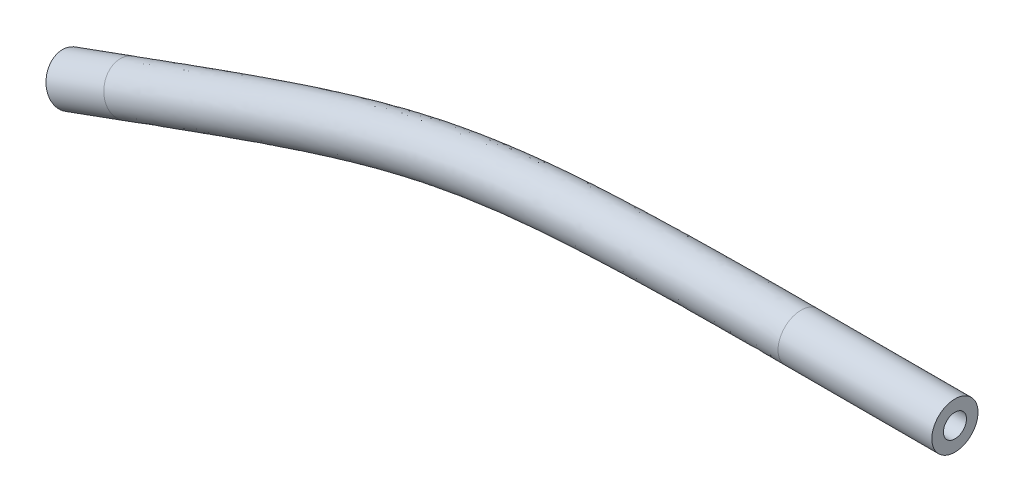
from build123d import *

# Parameters (mm, degrees)
ESQUISSE2_R   = 3
ESQUISSE2_R_2 = 1.5


with BuildPart() as part:
    # Balayage4: sweep along a path in Esquisse1
    with BuildLine() as balayage4_path:  # in the path sketch's own coordinates; laid on its plane below (add() does not lay a ready-made edge on the line's plane)
        Line((0, 0), (7.517540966, 2.736161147))
        add(Edge.make_bspline(
            [(7.517540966, 2.736161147), (46.199272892, 16.815160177), (51.878744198, 18.5), (95, 18.5)],
            knots=[0, 0, 0, 0, 1, 1, 1, 1], degree=3))
        Line((95, 18.5), (115, 18.5))
    # Esquisse2 → Balayage4 (sweep)
    with BuildSketch(Plane(origin=(115, 18.5, 0), x_dir=(0, 0, -1), z_dir=(1, 0, 0))):
        Circle(ESQUISSE2_R)
        Circle(ESQUISSE2_R_2, mode=Mode.SUBTRACT)
    sweep(path=Plane.XY * balayage4_path.line)


solid = part.part
